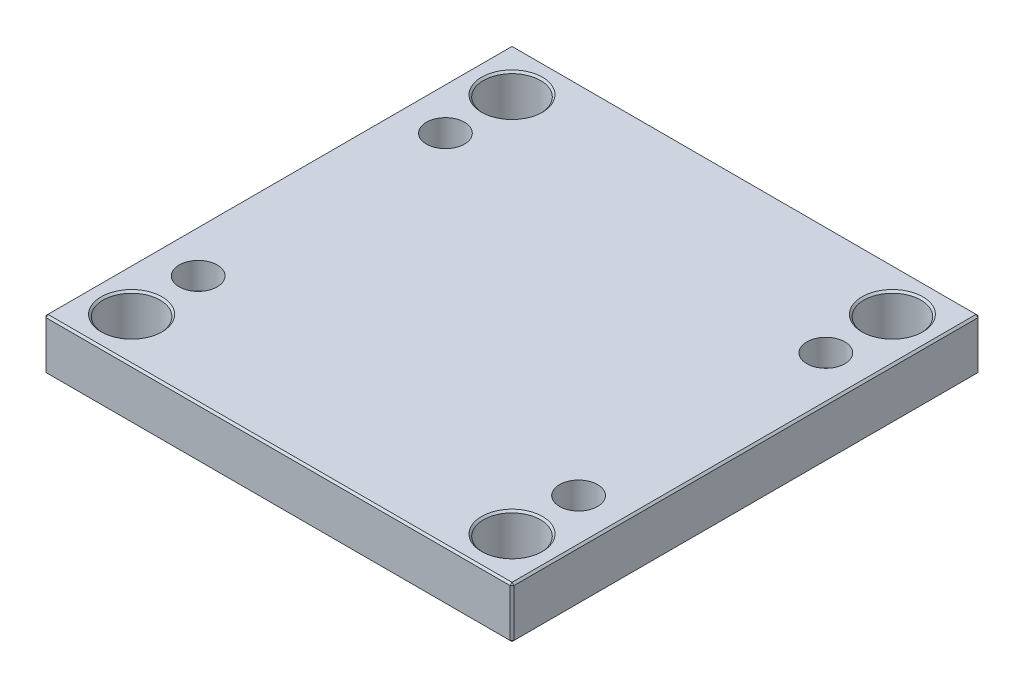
ISO-10303-21;
HEADER;
FILE_DESCRIPTION(('STEP AP214'),'2;1');
FILE_NAME('part.step','',(''),(''),'','','');
FILE_SCHEMA(('AUTOMOTIVE_DESIGN { 1 0 10303 214 1 1 1 1 }'));
ENDSEC;
DATA;
#1=APPLICATION_CONTEXT('core data for automotive mechanical design processes');
#2=APPLICATION_PROTOCOL_DEFINITION('international standard','automotive_design',2000,#1);
#3=PRODUCT_CONTEXT('',#1,'mechanical');
#4=PRODUCT('Part','Part','',(#3));
#5=PRODUCT_RELATED_PRODUCT_CATEGORY('part','',(#4));
#6=PRODUCT_DEFINITION_FORMATION('','',#4);
#7=PRODUCT_DEFINITION_CONTEXT('part definition',#1,'design');
#8=PRODUCT_DEFINITION('design','',#6,#7);
#9=PRODUCT_DEFINITION_SHAPE('','',#8);
#10=(LENGTH_UNIT() NAMED_UNIT(*) SI_UNIT(.MILLI.,.METRE.));
#11=(NAMED_UNIT(*) PLANE_ANGLE_UNIT() SI_UNIT($,.RADIAN.));
#12=(NAMED_UNIT(*) SI_UNIT($,.STERADIAN.) SOLID_ANGLE_UNIT());
#13=UNCERTAINTY_MEASURE_WITH_UNIT(LENGTH_MEASURE(1.E-05),#10,'distance_accuracy_value','');
#14=(GEOMETRIC_REPRESENTATION_CONTEXT(3) GLOBAL_UNCERTAINTY_ASSIGNED_CONTEXT((#13)) GLOBAL_UNIT_ASSIGNED_CONTEXT((#10,
#11,#12)) REPRESENTATION_CONTEXT('',''));
#15=CARTESIAN_POINT('',(0.,0.,0.));
#16=DIRECTION('',(0.,0.,1.));
#17=DIRECTION('',(1.,0.,0.));
#18=AXIS2_PLACEMENT_3D('',#15,#16,#17);
#19=CARTESIAN_POINT('',(-100.,0.,-65.));
#20=DIRECTION('',(0.,1.,0.));
#21=DIRECTION('',(0.,0.,1.));
#22=AXIS2_PLACEMENT_3D('',#19,#20,#21);
#23=CYLINDRICAL_SURFACE('',#22,6.);
#24=CARTESIAN_POINT('',(-100.,0.,-65.));
#25=DIRECTION('',(0.,1.,0.));
#26=DIRECTION('',(0.,0.,1.));
#27=AXIS2_PLACEMENT_3D('',#24,#25,#26);
#28=CIRCLE('',#27,6.);
#29=CARTESIAN_POINT('',(-100.,0.,-59.));
#30=VERTEX_POINT('',#29);
#31=EDGE_CURVE('E150',#30,#30,#28,.T.);
#32=ORIENTED_EDGE('',*,*,#31,.F.);
#33=EDGE_LOOP('',(#32));
#34=FACE_BOUND('',#33,.T.);
#35=CARTESIAN_POINT('',(-100.,13.,-65.));
#36=DIRECTION('',(0.,1.,0.));
#37=DIRECTION('',(0.,0.,1.));
#38=AXIS2_PLACEMENT_3D('',#35,#36,#37);
#39=CIRCLE('',#38,6.);
#40=CARTESIAN_POINT('',(-100.,13.,-59.));
#41=VERTEX_POINT('',#40);
#42=EDGE_CURVE('E20',#41,#41,#39,.F.);
#43=ORIENTED_EDGE('',*,*,#42,.F.);
#44=EDGE_LOOP('',(#43));
#45=FACE_BOUND('',#44,.T.);
#46=ADVANCED_FACE('F16',(#34,#45),#23,.F.);
#47=CARTESIAN_POINT('',(100.,0.,-65.));
#48=DIRECTION('',(0.,1.,0.));
#49=DIRECTION('',(0.,0.,1.));
#50=AXIS2_PLACEMENT_3D('',#47,#48,#49);
#51=CYLINDRICAL_SURFACE('',#50,6.);
#52=CARTESIAN_POINT('',(100.,0.,-65.));
#53=DIRECTION('',(0.,1.,0.));
#54=DIRECTION('',(0.,0.,1.));
#55=AXIS2_PLACEMENT_3D('',#52,#53,#54);
#56=CIRCLE('',#55,6.);
#57=CARTESIAN_POINT('',(100.,0.,-59.));
#58=VERTEX_POINT('',#57);
#59=EDGE_CURVE('E307',#58,#58,#56,.T.);
#60=ORIENTED_EDGE('',*,*,#59,.F.);
#61=EDGE_LOOP('',(#60));
#62=FACE_BOUND('',#61,.T.);
#63=CARTESIAN_POINT('',(100.,13.,-65.));
#64=DIRECTION('',(0.,1.,0.));
#65=DIRECTION('',(0.,0.,1.));
#66=AXIS2_PLACEMENT_3D('',#63,#64,#65);
#67=CIRCLE('',#66,6.);
#68=CARTESIAN_POINT('',(100.,13.,-59.));
#69=VERTEX_POINT('',#68);
#70=EDGE_CURVE('E294',#69,#69,#67,.F.);
#71=ORIENTED_EDGE('',*,*,#70,.F.);
#72=EDGE_LOOP('',(#71));
#73=FACE_BOUND('',#72,.T.);
#74=ADVANCED_FACE('F473',(#62,#73),#51,.F.);
#75=CARTESIAN_POINT('',(100.,0.,65.));
#76=DIRECTION('',(0.,1.,0.));
#77=DIRECTION('',(0.,0.,1.));
#78=AXIS2_PLACEMENT_3D('',#75,#76,#77);
#79=CYLINDRICAL_SURFACE('',#78,6.);
#80=CARTESIAN_POINT('',(100.,0.,65.));
#81=DIRECTION('',(0.,1.,0.));
#82=DIRECTION('',(0.,0.,1.));
#83=AXIS2_PLACEMENT_3D('',#80,#81,#82);
#84=CIRCLE('',#83,6.);
#85=CARTESIAN_POINT('',(100.,0.,71.));
#86=VERTEX_POINT('',#85);
#87=EDGE_CURVE('E303',#86,#86,#84,.T.);
#88=ORIENTED_EDGE('',*,*,#87,.F.);
#89=EDGE_LOOP('',(#88));
#90=FACE_BOUND('',#89,.T.);
#91=CARTESIAN_POINT('',(100.,13.,65.));
#92=DIRECTION('',(0.,1.,0.));
#93=DIRECTION('',(0.,0.,1.));
#94=AXIS2_PLACEMENT_3D('',#91,#92,#93);
#95=CIRCLE('',#94,6.);
#96=CARTESIAN_POINT('',(100.,13.,71.));
#97=VERTEX_POINT('',#96);
#98=EDGE_CURVE('E291',#97,#97,#95,.F.);
#99=ORIENTED_EDGE('',*,*,#98,.F.);
#100=EDGE_LOOP('',(#99));
#101=FACE_BOUND('',#100,.T.);
#102=ADVANCED_FACE('F480',(#90,#101),#79,.F.);
#103=CARTESIAN_POINT('',(-100.,0.,65.));
#104=DIRECTION('',(0.,1.,0.));
#105=DIRECTION('',(0.,0.,1.));
#106=AXIS2_PLACEMENT_3D('',#103,#104,#105);
#107=CYLINDRICAL_SURFACE('',#106,6.);
#108=CARTESIAN_POINT('',(-100.,0.,65.));
#109=DIRECTION('',(0.,1.,0.));
#110=DIRECTION('',(0.,0.,1.));
#111=AXIS2_PLACEMENT_3D('',#108,#109,#110);
#112=CIRCLE('',#111,6.);
#113=CARTESIAN_POINT('',(-100.,0.,71.));
#114=VERTEX_POINT('',#113);
#115=EDGE_CURVE('E299',#114,#114,#112,.T.);
#116=ORIENTED_EDGE('',*,*,#115,.F.);
#117=EDGE_LOOP('',(#116));
#118=FACE_BOUND('',#117,.T.);
#119=CARTESIAN_POINT('',(-100.,13.,65.));
#120=DIRECTION('',(0.,1.,0.));
#121=DIRECTION('',(0.,0.,1.));
#122=AXIS2_PLACEMENT_3D('',#119,#120,#121);
#123=CIRCLE('',#122,6.);
#124=CARTESIAN_POINT('',(-100.,13.,71.));
#125=VERTEX_POINT('',#124);
#126=EDGE_CURVE('E288',#125,#125,#123,.F.);
#127=ORIENTED_EDGE('',*,*,#126,.F.);
#128=EDGE_LOOP('',(#127));
#129=FACE_BOUND('',#128,.T.);
#130=ADVANCED_FACE('F485',(#118,#129),#107,.F.);
#131=CARTESIAN_POINT('',(-123.,27.,123.));
#132=DIRECTION('',(1.,0.,0.));
#133=DIRECTION('',(0.,0.,-1.));
#134=AXIS2_PLACEMENT_3D('',#131,#132,#133);
#135=PLANE('',#134);
#136=DIRECTION('',(0.,-1.,0.));
#137=VECTOR('',#136,1.);
#138=CARTESIAN_POINT('',(-123.,27.,-122.));
#139=LINE('',#138,#137);
#140=CARTESIAN_POINT('',(-123.,26.,-122.));
#141=VERTEX_POINT('',#140);
#142=CARTESIAN_POINT('',(-123.,1.,-122.));
#143=VERTEX_POINT('',#142);
#144=EDGE_CURVE('E118',#141,#143,#139,.T.);
#145=ORIENTED_EDGE('',*,*,#144,.T.);
#146=DIRECTION('',(0.,0.,1.));
#147=VECTOR('',#146,1.);
#148=CARTESIAN_POINT('',(-123.,1.,123.));
#149=LINE('',#148,#147);
#150=CARTESIAN_POINT('',(-123.,1.,122.));
#151=VERTEX_POINT('',#150);
#152=EDGE_CURVE('E114',#143,#151,#149,.T.);
#153=ORIENTED_EDGE('',*,*,#152,.T.);
#154=DIRECTION('',(0.,1.,0.));
#155=VECTOR('',#154,1.);
#156=CARTESIAN_POINT('',(-123.,27.,122.));
#157=LINE('',#156,#155);
#158=CARTESIAN_POINT('',(-123.,26.,122.));
#159=VERTEX_POINT('',#158);
#160=EDGE_CURVE('E106',#151,#159,#157,.T.);
#161=ORIENTED_EDGE('',*,*,#160,.T.);
#162=DIRECTION('',(0.,0.,-1.));
#163=VECTOR('',#162,1.);
#164=CARTESIAN_POINT('',(-123.,26.,-123.));
#165=LINE('',#164,#163);
#166=EDGE_CURVE('E111',#159,#141,#165,.T.);
#167=ORIENTED_EDGE('',*,*,#166,.T.);
#168=EDGE_LOOP('',(#145,#153,#161,#167));
#169=FACE_BOUND('',#168,.T.);
#170=ADVANCED_FACE('F109',(#169),#135,.F.);
#171=CARTESIAN_POINT('',(123.,27.,123.));
#172=DIRECTION('',(0.,0.,-1.));
#173=DIRECTION('',(-1.,0.,0.));
#174=AXIS2_PLACEMENT_3D('',#171,#172,#173);
#175=PLANE('',#174);
#176=DIRECTION('',(-1.,0.,0.));
#177=VECTOR('',#176,1.);
#178=CARTESIAN_POINT('',(-123.,26.,123.));
#179=LINE('',#178,#177);
#180=CARTESIAN_POINT('',(122.,26.,123.));
#181=VERTEX_POINT('',#180);
#182=CARTESIAN_POINT('',(-122.,26.,123.));
#183=VERTEX_POINT('',#182);
#184=EDGE_CURVE('E173',#181,#183,#179,.T.);
#185=ORIENTED_EDGE('',*,*,#184,.T.);
#186=DIRECTION('',(0.,-1.,0.));
#187=VECTOR('',#186,1.);
#188=CARTESIAN_POINT('',(-122.,27.,123.));
#189=LINE('',#188,#187);
#190=CARTESIAN_POINT('',(-122.,1.,123.));
#191=VERTEX_POINT('',#190);
#192=EDGE_CURVE('E126',#183,#191,#189,.T.);
#193=ORIENTED_EDGE('',*,*,#192,.T.);
#194=DIRECTION('',(1.,0.,0.));
#195=VECTOR('',#194,1.);
#196=CARTESIAN_POINT('',(123.,1.,123.));
#197=LINE('',#196,#195);
#198=CARTESIAN_POINT('',(122.,1.,123.));
#199=VERTEX_POINT('',#198);
#200=EDGE_CURVE('E177',#191,#199,#197,.T.);
#201=ORIENTED_EDGE('',*,*,#200,.T.);
#202=DIRECTION('',(0.,1.,0.));
#203=VECTOR('',#202,1.);
#204=CARTESIAN_POINT('',(122.,27.,123.));
#205=LINE('',#204,#203);
#206=EDGE_CURVE('E175',#199,#181,#205,.T.);
#207=ORIENTED_EDGE('',*,*,#206,.T.);
#208=EDGE_LOOP('',(#185,#193,#201,#207));
#209=FACE_BOUND('',#208,.T.);
#210=ADVANCED_FACE('F438',(#209),#175,.F.);
#211=CARTESIAN_POINT('',(123.,27.,123.));
#212=DIRECTION('',(-1.,0.,0.));
#213=DIRECTION('',(0.,0.,1.));
#214=AXIS2_PLACEMENT_3D('',#211,#212,#213);
#215=PLANE('',#214);
#216=DIRECTION('',(0.,0.,-1.));
#217=VECTOR('',#216,1.);
#218=CARTESIAN_POINT('',(123.,1.,123.));
#219=LINE('',#218,#217);
#220=CARTESIAN_POINT('',(123.,1.,122.));
#221=VERTEX_POINT('',#220);
#222=CARTESIAN_POINT('',(123.,1.,-122.));
#223=VERTEX_POINT('',#222);
#224=EDGE_CURVE('E168',#221,#223,#219,.T.);
#225=ORIENTED_EDGE('',*,*,#224,.T.);
#226=DIRECTION('',(0.,1.,0.));
#227=VECTOR('',#226,1.);
#228=CARTESIAN_POINT('',(123.,27.,-122.));
#229=LINE('',#228,#227);
#230=CARTESIAN_POINT('',(123.,26.,-122.));
#231=VERTEX_POINT('',#230);
#232=EDGE_CURVE('E170',#223,#231,#229,.T.);
#233=ORIENTED_EDGE('',*,*,#232,.T.);
#234=DIRECTION('',(0.,0.,1.));
#235=VECTOR('',#234,1.);
#236=CARTESIAN_POINT('',(123.,26.,123.));
#237=LINE('',#236,#235);
#238=CARTESIAN_POINT('',(123.,26.,122.));
#239=VERTEX_POINT('',#238);
#240=EDGE_CURVE('E164',#231,#239,#237,.T.);
#241=ORIENTED_EDGE('',*,*,#240,.T.);
#242=DIRECTION('',(0.,-1.,0.));
#243=VECTOR('',#242,1.);
#244=CARTESIAN_POINT('',(123.,27.,122.));
#245=LINE('',#244,#243);
#246=EDGE_CURVE('E166',#239,#221,#245,.T.);
#247=ORIENTED_EDGE('',*,*,#246,.T.);
#248=EDGE_LOOP('',(#225,#233,#241,#247));
#249=FACE_BOUND('',#248,.T.);
#250=ADVANCED_FACE('F431',(#249),#215,.F.);
#251=CARTESIAN_POINT('',(123.,27.,-123.));
#252=DIRECTION('',(0.,0.,1.));
#253=DIRECTION('',(1.,0.,0.));
#254=AXIS2_PLACEMENT_3D('',#251,#252,#253);
#255=PLANE('',#254);
#256=DIRECTION('',(0.,-1.,0.));
#257=VECTOR('',#256,1.);
#258=CARTESIAN_POINT('',(122.,27.,-123.));
#259=LINE('',#258,#257);
#260=CARTESIAN_POINT('',(122.,26.,-123.));
#261=VERTEX_POINT('',#260);
#262=CARTESIAN_POINT('',(122.,1.,-123.));
#263=VERTEX_POINT('',#262);
#264=EDGE_CURVE('E157',#261,#263,#259,.T.);
#265=ORIENTED_EDGE('',*,*,#264,.T.);
#266=DIRECTION('',(-1.,0.,0.));
#267=VECTOR('',#266,1.);
#268=CARTESIAN_POINT('',(123.,1.,-123.));
#269=LINE('',#268,#267);
#270=CARTESIAN_POINT('',(-122.,1.,-123.));
#271=VERTEX_POINT('',#270);
#272=EDGE_CURVE('E162',#263,#271,#269,.T.);
#273=ORIENTED_EDGE('',*,*,#272,.T.);
#274=DIRECTION('',(0.,1.,0.));
#275=VECTOR('',#274,1.);
#276=CARTESIAN_POINT('',(-122.,27.,-123.));
#277=LINE('',#276,#275);
#278=CARTESIAN_POINT('',(-122.,26.,-123.));
#279=VERTEX_POINT('',#278);
#280=EDGE_CURVE('E159',#271,#279,#277,.T.);
#281=ORIENTED_EDGE('',*,*,#280,.T.);
#282=DIRECTION('',(1.,0.,0.));
#283=VECTOR('',#282,1.);
#284=CARTESIAN_POINT('',(123.,26.,-123.));
#285=LINE('',#284,#283);
#286=EDGE_CURVE('E155',#279,#261,#285,.T.);
#287=ORIENTED_EDGE('',*,*,#286,.T.);
#288=EDGE_LOOP('',(#265,#273,#281,#287));
#289=FACE_BOUND('',#288,.T.);
#290=ADVANCED_FACE('F349',(#289),#255,.F.);
#291=CARTESIAN_POINT('',(0.,27.,0.));
#292=DIRECTION('',(0.,1.,0.));
#293=DIRECTION('',(0.,0.,1.));
#294=AXIS2_PLACEMENT_3D('',#291,#292,#293);
#295=PLANE('',#294);
#296=CARTESIAN_POINT('',(-100.,27.,65.));
#297=DIRECTION('',(0.,1.,0.));
#298=DIRECTION('',(0.,0.,1.));
#299=AXIS2_PLACEMENT_3D('',#296,#297,#298);
#300=CIRCLE('',#299,10.);
#301=CARTESIAN_POINT('',(-100.,27.,75.));
#302=VERTEX_POINT('',#301);
#303=EDGE_CURVE('E318',#302,#302,#300,.T.);
#304=ORIENTED_EDGE('',*,*,#303,.F.);
#305=EDGE_LOOP('',(#304));
#306=FACE_BOUND('',#305,.T.);
#307=CARTESIAN_POINT('',(100.,27.,65.));
#308=DIRECTION('',(0.,1.,0.));
#309=DIRECTION('',(0.,0.,1.));
#310=AXIS2_PLACEMENT_3D('',#307,#308,#309);
#311=CIRCLE('',#310,10.);
#312=CARTESIAN_POINT('',(100.,27.,75.));
#313=VERTEX_POINT('',#312);
#314=EDGE_CURVE('E324',#313,#313,#311,.T.);
#315=ORIENTED_EDGE('',*,*,#314,.F.);
#316=EDGE_LOOP('',(#315));
#317=FACE_BOUND('',#316,.T.);
#318=CARTESIAN_POINT('',(100.,27.,-65.));
#319=DIRECTION('',(0.,1.,0.));
#320=DIRECTION('',(0.,0.,1.));
#321=AXIS2_PLACEMENT_3D('',#318,#319,#320);
#322=CIRCLE('',#321,10.);
#323=CARTESIAN_POINT('',(100.,27.,-55.));
#324=VERTEX_POINT('',#323);
#325=EDGE_CURVE('E330',#324,#324,#322,.T.);
#326=ORIENTED_EDGE('',*,*,#325,.F.);
#327=EDGE_LOOP('',(#326));
#328=FACE_BOUND('',#327,.T.);
#329=CARTESIAN_POINT('',(-100.,27.,-65.));
#330=DIRECTION('',(0.,1.,0.));
#331=DIRECTION('',(0.,0.,1.));
#332=AXIS2_PLACEMENT_3D('',#329,#330,#331);
#333=CIRCLE('',#332,10.);
#334=CARTESIAN_POINT('',(-100.,27.,-55.));
#335=VERTEX_POINT('',#334);
#336=EDGE_CURVE('E312',#335,#335,#333,.T.);
#337=ORIENTED_EDGE('',*,*,#336,.F.);
#338=EDGE_LOOP('',(#337));
#339=FACE_BOUND('',#338,.T.);
#340=CARTESIAN_POINT('',(-100.,27.,100.));
#341=DIRECTION('',(0.,1.,0.));
#342=DIRECTION('',(0.,0.,1.));
#343=AXIS2_PLACEMENT_3D('',#340,#341,#342);
#344=CIRCLE('',#343,16.);
#345=CARTESIAN_POINT('',(-100.,27.,116.));
#346=VERTEX_POINT('',#345);
#347=EDGE_CURVE('E259',#346,#346,#344,.F.);
#348=ORIENTED_EDGE('',*,*,#347,.T.);
#349=EDGE_LOOP('',(#348));
#350=FACE_BOUND('',#349,.T.);
#351=CARTESIAN_POINT('',(100.,27.,100.));
#352=DIRECTION('',(0.,1.,0.));
#353=DIRECTION('',(0.,0.,1.));
#354=AXIS2_PLACEMENT_3D('',#351,#352,#353);
#355=CIRCLE('',#354,16.);
#356=CARTESIAN_POINT('',(100.,27.,116.));
#357=VERTEX_POINT('',#356);
#358=EDGE_CURVE('E256',#357,#357,#355,.F.);
#359=ORIENTED_EDGE('',*,*,#358,.T.);
#360=EDGE_LOOP('',(#359));
#361=FACE_BOUND('',#360,.T.);
#362=CARTESIAN_POINT('',(100.,27.,-100.));
#363=DIRECTION('',(0.,1.,0.));
#364=DIRECTION('',(0.,0.,1.));
#365=AXIS2_PLACEMENT_3D('',#362,#363,#364);
#366=CIRCLE('',#365,16.);
#367=CARTESIAN_POINT('',(100.,27.,-84.));
#368=VERTEX_POINT('',#367);
#369=EDGE_CURVE('E253',#368,#368,#366,.F.);
#370=ORIENTED_EDGE('',*,*,#369,.T.);
#371=EDGE_LOOP('',(#370));
#372=FACE_BOUND('',#371,.T.);
#373=CARTESIAN_POINT('',(-100.,27.,-100.));
#374=DIRECTION('',(0.,1.,0.));
#375=DIRECTION('',(0.,0.,1.));
#376=AXIS2_PLACEMENT_3D('',#373,#374,#375);
#377=CIRCLE('',#376,16.);
#378=CARTESIAN_POINT('',(-100.,27.,-84.));
#379=VERTEX_POINT('',#378);
#380=EDGE_CURVE('E250',#379,#379,#377,.F.);
#381=ORIENTED_EDGE('',*,*,#380,.T.);
#382=EDGE_LOOP('',(#381));
#383=FACE_BOUND('',#382,.T.);
#384=DIRECTION('',(0.,0.,-1.));
#385=VECTOR('',#384,1.);
#386=CARTESIAN_POINT('',(122.,27.,-123.));
#387=LINE('',#386,#385);
#388=CARTESIAN_POINT('',(122.,27.,122.));
#389=VERTEX_POINT('',#388);
#390=CARTESIAN_POINT('',(122.,27.,-122.));
#391=VERTEX_POINT('',#390);
#392=EDGE_CURVE('E33',#389,#391,#387,.T.);
#393=ORIENTED_EDGE('',*,*,#392,.T.);
#394=DIRECTION('',(-1.,0.,0.));
#395=VECTOR('',#394,1.);
#396=CARTESIAN_POINT('',(-123.,27.,-122.));
#397=LINE('',#396,#395);
#398=CARTESIAN_POINT('',(-122.,27.,-122.));
#399=VERTEX_POINT('',#398);
#400=EDGE_CURVE('E193',#391,#399,#397,.T.);
#401=ORIENTED_EDGE('',*,*,#400,.T.);
#402=DIRECTION('',(0.,0.,1.));
#403=VECTOR('',#402,1.);
#404=CARTESIAN_POINT('',(-122.,27.,123.));
#405=LINE('',#404,#403);
#406=CARTESIAN_POINT('',(-122.,27.,122.));
#407=VERTEX_POINT('',#406);
#408=EDGE_CURVE('E189',#399,#407,#405,.T.);
#409=ORIENTED_EDGE('',*,*,#408,.T.);
#410=DIRECTION('',(1.,0.,0.));
#411=VECTOR('',#410,1.);
#412=CARTESIAN_POINT('',(123.,27.,122.));
#413=LINE('',#412,#411);
#414=EDGE_CURVE('E38',#407,#389,#413,.T.);
#415=ORIENTED_EDGE('',*,*,#414,.T.);
#416=EDGE_LOOP('',(#393,#401,#409,#415));
#417=FACE_BOUND('',#416,.T.);
#418=ADVANCED_FACE('F345',(#306,#317,#328,#339,#350,#361,#372,#383,#417),#295,.T.);
#419=CARTESIAN_POINT('',(0.,0.,0.));
#420=DIRECTION('',(0.,1.,0.));
#421=DIRECTION('',(0.,0.,1.));
#422=AXIS2_PLACEMENT_3D('',#419,#420,#421);
#423=PLANE('',#422);
#424=CARTESIAN_POINT('',(-100.,0.,100.));
#425=DIRECTION('',(0.,1.,0.));
#426=DIRECTION('',(0.,0.,1.));
#427=AXIS2_PLACEMENT_3D('',#424,#425,#426);
#428=CIRCLE('',#427,16.);
#429=CARTESIAN_POINT('',(-100.,0.,116.));
#430=VERTEX_POINT('',#429);
#431=EDGE_CURVE('E271',#430,#430,#428,.T.);
#432=ORIENTED_EDGE('',*,*,#431,.T.);
#433=EDGE_LOOP('',(#432));
#434=FACE_BOUND('',#433,.T.);
#435=CARTESIAN_POINT('',(100.,0.,100.));
#436=DIRECTION('',(0.,1.,0.));
#437=DIRECTION('',(0.,0.,1.));
#438=AXIS2_PLACEMENT_3D('',#435,#436,#437);
#439=CIRCLE('',#438,16.);
#440=CARTESIAN_POINT('',(100.,0.,116.));
#441=VERTEX_POINT('',#440);
#442=EDGE_CURVE('E268',#441,#441,#439,.T.);
#443=ORIENTED_EDGE('',*,*,#442,.T.);
#444=EDGE_LOOP('',(#443));
#445=FACE_BOUND('',#444,.T.);
#446=CARTESIAN_POINT('',(100.,0.,-100.));
#447=DIRECTION('',(0.,1.,0.));
#448=DIRECTION('',(0.,0.,1.));
#449=AXIS2_PLACEMENT_3D('',#446,#447,#448);
#450=CIRCLE('',#449,16.);
#451=CARTESIAN_POINT('',(100.,0.,-84.));
#452=VERTEX_POINT('',#451);
#453=EDGE_CURVE('E265',#452,#452,#450,.T.);
#454=ORIENTED_EDGE('',*,*,#453,.T.);
#455=EDGE_LOOP('',(#454));
#456=FACE_BOUND('',#455,.T.);
#457=CARTESIAN_POINT('',(-100.,0.,-100.));
#458=DIRECTION('',(0.,1.,0.));
#459=DIRECTION('',(0.,0.,1.));
#460=AXIS2_PLACEMENT_3D('',#457,#458,#459);
#461=CIRCLE('',#460,16.);
#462=CARTESIAN_POINT('',(-100.,0.,-84.));
#463=VERTEX_POINT('',#462);
#464=EDGE_CURVE('E262',#463,#463,#461,.T.);
#465=ORIENTED_EDGE('',*,*,#464,.T.);
#466=EDGE_LOOP('',(#465));
#467=FACE_BOUND('',#466,.T.);
#468=ORIENTED_EDGE('',*,*,#115,.T.);
#469=EDGE_LOOP('',(#468));
#470=FACE_BOUND('',#469,.T.);
#471=ORIENTED_EDGE('',*,*,#87,.T.);
#472=EDGE_LOOP('',(#471));
#473=FACE_BOUND('',#472,.T.);
#474=ORIENTED_EDGE('',*,*,#59,.T.);
#475=EDGE_LOOP('',(#474));
#476=FACE_BOUND('',#475,.T.);
#477=ORIENTED_EDGE('',*,*,#31,.T.);
#478=EDGE_LOOP('',(#477));
#479=FACE_BOUND('',#478,.T.);
#480=DIRECTION('',(0.,0.,1.));
#481=VECTOR('',#480,1.);
#482=CARTESIAN_POINT('',(122.,0.,0.));
#483=LINE('',#482,#481);
#484=CARTESIAN_POINT('',(122.,0.,-122.));
#485=VERTEX_POINT('',#484);
#486=CARTESIAN_POINT('',(122.,0.,122.));
#487=VERTEX_POINT('',#486);
#488=EDGE_CURVE('E180',#485,#487,#483,.T.);
#489=ORIENTED_EDGE('',*,*,#488,.T.);
#490=DIRECTION('',(-1.,0.,0.));
#491=VECTOR('',#490,1.);
#492=CARTESIAN_POINT('',(0.,0.,122.));
#493=LINE('',#492,#491);
#494=CARTESIAN_POINT('',(-122.,0.,122.));
#495=VERTEX_POINT('',#494);
#496=EDGE_CURVE('E186',#487,#495,#493,.T.);
#497=ORIENTED_EDGE('',*,*,#496,.T.);
#498=DIRECTION('',(0.,0.,-1.));
#499=VECTOR('',#498,1.);
#500=CARTESIAN_POINT('',(-122.,0.,0.));
#501=LINE('',#500,#499);
#502=CARTESIAN_POINT('',(-122.,0.,-122.));
#503=VERTEX_POINT('',#502);
#504=EDGE_CURVE('E184',#495,#503,#501,.T.);
#505=ORIENTED_EDGE('',*,*,#504,.T.);
#506=DIRECTION('',(1.,0.,0.));
#507=VECTOR('',#506,1.);
#508=CARTESIAN_POINT('',(0.,0.,-122.));
#509=LINE('',#508,#507);
#510=EDGE_CURVE('E182',#503,#485,#509,.T.);
#511=ORIENTED_EDGE('',*,*,#510,.T.);
#512=EDGE_LOOP('',(#489,#497,#505,#511));
#513=FACE_BOUND('',#512,.T.);
#514=ADVANCED_FACE('F348',(#434,#445,#456,#467,#470,#473,#476,#479,#513),#423,.F.);
#515=CARTESIAN_POINT('',(123.,27.,122.));
#516=DIRECTION('',(-0.707106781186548,0.,-0.707106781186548));
#517=DIRECTION('',(0.,-1.,0.));
#518=AXIS2_PLACEMENT_3D('',#515,#516,#517);
#519=PLANE('',#518);
#520=DIRECTION('',(-0.707106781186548,0.,0.707106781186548));
#521=VECTOR('',#520,1.);
#522=CARTESIAN_POINT('',(122.,26.,123.));
#523=LINE('',#522,#521);
#524=EDGE_CURVE('E144',#181,#239,#523,.F.);
#525=ORIENTED_EDGE('',*,*,#524,.F.);
#526=ORIENTED_EDGE('',*,*,#206,.F.);
#527=DIRECTION('',(0.707106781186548,0.,-0.707106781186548));
#528=VECTOR('',#527,1.);
#529=CARTESIAN_POINT('',(122.,1.,123.));
#530=LINE('',#529,#528);
#531=EDGE_CURVE('E147',#221,#199,#530,.F.);
#532=ORIENTED_EDGE('',*,*,#531,.F.);
#533=ORIENTED_EDGE('',*,*,#246,.F.);
#534=EDGE_LOOP('',(#525,#526,#532,#533));
#535=FACE_BOUND('',#534,.T.);
#536=ADVANCED_FACE('F382',(#535),#519,.F.);
#537=CARTESIAN_POINT('',(122.,26.,123.));
#538=DIRECTION('',(0.577350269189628,0.57735026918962,0.577350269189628));
#539=DIRECTION('',(0.707106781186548,0.,-0.707106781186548));
#540=AXIS2_PLACEMENT_3D('',#537,#538,#539);
#541=PLANE('',#540);
#542=DIRECTION('',(0.,-0.70710678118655,0.707106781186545));
#543=VECTOR('',#542,1.);
#544=CARTESIAN_POINT('',(122.,26.,123.));
#545=LINE('',#544,#543);
#546=EDGE_CURVE('E238',#181,#389,#545,.F.);
#547=ORIENTED_EDGE('',*,*,#546,.F.);
#548=ORIENTED_EDGE('',*,*,#524,.T.);
#549=DIRECTION('',(-0.707106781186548,0.707106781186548,0.));
#550=VECTOR('',#549,1.);
#551=CARTESIAN_POINT('',(122.5,26.5,122.));
#552=LINE('',#551,#550);
#553=EDGE_CURVE('E240',#389,#239,#552,.F.);
#554=ORIENTED_EDGE('',*,*,#553,.F.);
#555=EDGE_LOOP('',(#547,#548,#554));
#556=FACE_BOUND('',#555,.T.);
#557=ADVANCED_FACE('F444',(#556),#541,.T.);
#558=CARTESIAN_POINT('',(122.,1.,123.));
#559=DIRECTION('',(0.577350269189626,-0.577350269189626,0.577350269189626));
#560=DIRECTION('',(0.707106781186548,0.,-0.707106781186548));
#561=AXIS2_PLACEMENT_3D('',#558,#559,#560);
#562=PLANE('',#561);
#563=DIRECTION('',(-0.707106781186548,-0.707106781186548,0.));
#564=VECTOR('',#563,1.);
#565=CARTESIAN_POINT('',(122.5,0.5,122.));
#566=LINE('',#565,#564);
#567=EDGE_CURVE('E232',#221,#487,#566,.T.);
#568=ORIENTED_EDGE('',*,*,#567,.F.);
#569=ORIENTED_EDGE('',*,*,#531,.T.);
#570=DIRECTION('',(0.,0.70710678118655,0.707106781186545));
#571=VECTOR('',#570,1.);
#572=CARTESIAN_POINT('',(122.,1.,123.));
#573=LINE('',#572,#571);
#574=EDGE_CURVE('E235',#487,#199,#573,.T.);
#575=ORIENTED_EDGE('',*,*,#574,.F.);
#576=EDGE_LOOP('',(#568,#569,#575));
#577=FACE_BOUND('',#576,.T.);
#578=ADVANCED_FACE('F403',(#577),#562,.T.);
#579=CARTESIAN_POINT('',(122.,27.,0.));
#580=DIRECTION('',(0.707106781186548,0.707106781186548,0.));
#581=DIRECTION('',(0.,0.,1.));
#582=AXIS2_PLACEMENT_3D('',#579,#580,#581);
#583=PLANE('',#582);
#584=ORIENTED_EDGE('',*,*,#553,.T.);
#585=ORIENTED_EDGE('',*,*,#240,.F.);
#586=DIRECTION('',(0.707106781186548,-0.707106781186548,0.));
#587=VECTOR('',#586,1.);
#588=CARTESIAN_POINT('',(123.,26.,-122.));
#589=LINE('',#588,#587);
#590=EDGE_CURVE('E227',#391,#231,#589,.T.);
#591=ORIENTED_EDGE('',*,*,#590,.F.);
#592=ORIENTED_EDGE('',*,*,#392,.F.);
#593=EDGE_LOOP('',(#584,#585,#591,#592));
#594=FACE_BOUND('',#593,.T.);
#595=ADVANCED_FACE('F446',(#594),#583,.T.);
#596=CARTESIAN_POINT('',(0.,27.,122.));
#597=DIRECTION('',(0.,0.707106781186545,0.70710678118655));
#598=DIRECTION('',(-1.,0.,0.));
#599=AXIS2_PLACEMENT_3D('',#596,#597,#598);
#600=PLANE('',#599);
#601=ORIENTED_EDGE('',*,*,#546,.T.);
#602=ORIENTED_EDGE('',*,*,#414,.F.);
#603=DIRECTION('',(0.,0.70710678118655,-0.707106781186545));
#604=VECTOR('',#603,1.);
#605=CARTESIAN_POINT('',(-122.,26.5,122.5));
#606=LINE('',#605,#604);
#607=EDGE_CURVE('E130',#183,#407,#606,.T.);
#608=ORIENTED_EDGE('',*,*,#607,.F.);
#609=ORIENTED_EDGE('',*,*,#184,.F.);
#610=EDGE_LOOP('',(#601,#602,#608,#609));
#611=FACE_BOUND('',#610,.T.);
#612=ADVANCED_FACE('F441',(#611),#600,.T.);
#613=CARTESIAN_POINT('',(-122.,27.,123.));
#614=DIRECTION('',(0.707106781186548,0.,-0.707106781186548));
#615=DIRECTION('',(0.,-1.,0.));
#616=AXIS2_PLACEMENT_3D('',#613,#614,#615);
#617=PLANE('',#616);
#618=DIRECTION('',(0.707106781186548,0.,0.707106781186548));
#619=VECTOR('',#618,1.);
#620=CARTESIAN_POINT('',(-122.,1.,123.));
#621=LINE('',#620,#619);
#622=EDGE_CURVE('E131',#191,#151,#621,.F.);
#623=ORIENTED_EDGE('',*,*,#622,.F.);
#624=ORIENTED_EDGE('',*,*,#192,.F.);
#625=DIRECTION('',(-0.707106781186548,0.,-0.707106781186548));
#626=VECTOR('',#625,1.);
#627=CARTESIAN_POINT('',(-123.,26.,122.));
#628=LINE('',#627,#626);
#629=EDGE_CURVE('E122',#159,#183,#628,.F.);
#630=ORIENTED_EDGE('',*,*,#629,.F.);
#631=ORIENTED_EDGE('',*,*,#160,.F.);
#632=EDGE_LOOP('',(#623,#624,#630,#631));
#633=FACE_BOUND('',#632,.T.);
#634=ADVANCED_FACE('F124',(#633),#617,.F.);
#635=CARTESIAN_POINT('',(123.,1.,123.));
#636=DIRECTION('',(0.,0.707106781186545,-0.70710678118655));
#637=DIRECTION('',(1.,0.,0.));
#638=AXIS2_PLACEMENT_3D('',#635,#636,#637);
#639=PLANE('',#638);
#640=ORIENTED_EDGE('',*,*,#574,.T.);
#641=ORIENTED_EDGE('',*,*,#200,.F.);
#642=DIRECTION('',(0.,-0.70710678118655,-0.707106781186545));
#643=VECTOR('',#642,1.);
#644=CARTESIAN_POINT('',(-122.,1.,123.));
#645=LINE('',#644,#643);
#646=EDGE_CURVE('E223',#495,#191,#645,.F.);
#647=ORIENTED_EDGE('',*,*,#646,.F.);
#648=ORIENTED_EDGE('',*,*,#496,.F.);
#649=EDGE_LOOP('',(#640,#641,#647,#648));
#650=FACE_BOUND('',#649,.T.);
#651=ADVANCED_FACE('F408',(#650),#639,.F.);
#652=CARTESIAN_POINT('',(123.,1.,123.));
#653=DIRECTION('',(-0.707106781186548,0.707106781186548,0.));
#654=DIRECTION('',(0.,0.,-1.));
#655=AXIS2_PLACEMENT_3D('',#652,#653,#654);
#656=PLANE('',#655);
#657=ORIENTED_EDGE('',*,*,#567,.T.);
#658=ORIENTED_EDGE('',*,*,#488,.F.);
#659=DIRECTION('',(0.707106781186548,0.707106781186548,0.));
#660=VECTOR('',#659,1.);
#661=CARTESIAN_POINT('',(122.5,0.499999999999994,-122.));
#662=LINE('',#661,#660);
#663=EDGE_CURVE('E220',#223,#485,#662,.F.);
#664=ORIENTED_EDGE('',*,*,#663,.F.);
#665=ORIENTED_EDGE('',*,*,#224,.F.);
#666=EDGE_LOOP('',(#657,#658,#664,#665));
#667=FACE_BOUND('',#666,.T.);
#668=ADVANCED_FACE('F401',(#667),#656,.F.);
#669=CARTESIAN_POINT('',(122.,27.,-123.));
#670=DIRECTION('',(-0.707106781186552,0.,0.707106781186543));
#671=DIRECTION('',(0.,-1.,0.));
#672=AXIS2_PLACEMENT_3D('',#669,#670,#671);
#673=PLANE('',#672);
#674=DIRECTION('',(0.707106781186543,0.,0.707106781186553));
#675=VECTOR('',#674,1.);
#676=CARTESIAN_POINT('',(123.,26.,-122.));
#677=LINE('',#676,#675);
#678=EDGE_CURVE('E229',#231,#261,#677,.F.);
#679=ORIENTED_EDGE('',*,*,#678,.F.);
#680=ORIENTED_EDGE('',*,*,#232,.F.);
#681=DIRECTION('',(-0.707106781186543,0.,-0.707106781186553));
#682=VECTOR('',#681,1.);
#683=CARTESIAN_POINT('',(122.,1.,-123.));
#684=LINE('',#683,#682);
#685=EDGE_CURVE('E217',#263,#223,#684,.F.);
#686=ORIENTED_EDGE('',*,*,#685,.F.);
#687=ORIENTED_EDGE('',*,*,#264,.F.);
#688=EDGE_LOOP('',(#679,#680,#686,#687));
#689=FACE_BOUND('',#688,.T.);
#690=ADVANCED_FACE('F428',(#689),#673,.F.);
#691=CARTESIAN_POINT('',(123.,26.,-122.));
#692=DIRECTION('',(0.577350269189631,0.577350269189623,-0.577350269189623));
#693=DIRECTION('',(-0.707106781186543,0.,-0.707106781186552));
#694=AXIS2_PLACEMENT_3D('',#691,#692,#693);
#695=PLANE('',#694);
#696=ORIENTED_EDGE('',*,*,#590,.T.);
#697=ORIENTED_EDGE('',*,*,#678,.T.);
#698=DIRECTION('',(0.,0.707106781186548,0.707106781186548));
#699=VECTOR('',#698,1.);
#700=CARTESIAN_POINT('',(122.,26.5,-122.5));
#701=LINE('',#700,#699);
#702=EDGE_CURVE('E138',#391,#261,#701,.F.);
#703=ORIENTED_EDGE('',*,*,#702,.F.);
#704=EDGE_LOOP('',(#696,#697,#703));
#705=FACE_BOUND('',#704,.T.);
#706=ADVANCED_FACE('F450',(#705),#695,.T.);
#707=CARTESIAN_POINT('',(-123.,26.,122.));
#708=DIRECTION('',(-0.577350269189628,0.57735026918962,0.577350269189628));
#709=DIRECTION('',(0.707106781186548,0.,0.707106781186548));
#710=AXIS2_PLACEMENT_3D('',#707,#708,#709);
#711=PLANE('',#710);
#712=ORIENTED_EDGE('',*,*,#629,.T.);
#713=ORIENTED_EDGE('',*,*,#607,.T.);
#714=DIRECTION('',(-0.707106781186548,-0.707106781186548,0.));
#715=VECTOR('',#714,1.);
#716=CARTESIAN_POINT('',(-123.,26.,122.));
#717=LINE('',#716,#715);
#718=EDGE_CURVE('E134',#159,#407,#717,.F.);
#719=ORIENTED_EDGE('',*,*,#718,.F.);
#720=EDGE_LOOP('',(#712,#713,#719));
#721=FACE_BOUND('',#720,.T.);
#722=ADVANCED_FACE('F135',(#721),#711,.T.);
#723=CARTESIAN_POINT('',(-122.,1.,123.));
#724=DIRECTION('',(-0.577350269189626,-0.577350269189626,0.577350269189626));
#725=DIRECTION('',(0.707106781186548,0.,0.707106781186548));
#726=AXIS2_PLACEMENT_3D('',#723,#724,#725);
#727=PLANE('',#726);
#728=ORIENTED_EDGE('',*,*,#646,.T.);
#729=ORIENTED_EDGE('',*,*,#622,.T.);
#730=DIRECTION('',(-0.707106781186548,0.707106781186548,0.));
#731=VECTOR('',#730,1.);
#732=CARTESIAN_POINT('',(-122.5,0.5,122.));
#733=LINE('',#732,#731);
#734=EDGE_CURVE('E139',#495,#151,#733,.T.);
#735=ORIENTED_EDGE('',*,*,#734,.F.);
#736=EDGE_LOOP('',(#728,#729,#735));
#737=FACE_BOUND('',#736,.T.);
#738=ADVANCED_FACE('F411',(#737),#727,.T.);
#739=CARTESIAN_POINT('',(122.,1.,-123.));
#740=DIRECTION('',(0.577350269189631,-0.577350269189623,-0.577350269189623));
#741=DIRECTION('',(-0.707106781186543,0.,-0.707106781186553));
#742=AXIS2_PLACEMENT_3D('',#739,#740,#741);
#743=PLANE('',#742);
#744=ORIENTED_EDGE('',*,*,#685,.T.);
#745=ORIENTED_EDGE('',*,*,#663,.T.);
#746=DIRECTION('',(0.,-0.707106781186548,0.707106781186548));
#747=VECTOR('',#746,1.);
#748=CARTESIAN_POINT('',(122.,1.,-123.));
#749=LINE('',#748,#747);
#750=EDGE_CURVE('E210',#263,#485,#749,.T.);
#751=ORIENTED_EDGE('',*,*,#750,.F.);
#752=EDGE_LOOP('',(#744,#745,#751));
#753=FACE_BOUND('',#752,.T.);
#754=ADVANCED_FACE('F422',(#753),#743,.T.);
#755=CARTESIAN_POINT('',(0.,27.,-122.));
#756=DIRECTION('',(0.,0.707106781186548,-0.707106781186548));
#757=DIRECTION('',(1.,0.,0.));
#758=AXIS2_PLACEMENT_3D('',#755,#756,#757);
#759=PLANE('',#758);
#760=ORIENTED_EDGE('',*,*,#702,.T.);
#761=ORIENTED_EDGE('',*,*,#286,.F.);
#762=DIRECTION('',(0.,-0.707106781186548,-0.707106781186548));
#763=VECTOR('',#762,1.);
#764=CARTESIAN_POINT('',(-122.,26.,-123.));
#765=LINE('',#764,#763);
#766=EDGE_CURVE('E207',#399,#279,#765,.T.);
#767=ORIENTED_EDGE('',*,*,#766,.F.);
#768=ORIENTED_EDGE('',*,*,#400,.F.);
#769=EDGE_LOOP('',(#760,#761,#767,#768));
#770=FACE_BOUND('',#769,.T.);
#771=ADVANCED_FACE('F454',(#770),#759,.T.);
#772=CARTESIAN_POINT('',(-122.,27.,0.));
#773=DIRECTION('',(-0.707106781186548,0.707106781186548,0.));
#774=DIRECTION('',(0.,0.,-1.));
#775=AXIS2_PLACEMENT_3D('',#772,#773,#774);
#776=PLANE('',#775);
#777=ORIENTED_EDGE('',*,*,#718,.T.);
#778=ORIENTED_EDGE('',*,*,#408,.F.);
#779=DIRECTION('',(0.707106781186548,0.707106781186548,0.));
#780=VECTOR('',#779,1.);
#781=CARTESIAN_POINT('',(-122.5,26.5,-122.));
#782=LINE('',#781,#780);
#783=EDGE_CURVE('E142',#141,#399,#782,.T.);
#784=ORIENTED_EDGE('',*,*,#783,.F.);
#785=ORIENTED_EDGE('',*,*,#166,.F.);
#786=EDGE_LOOP('',(#777,#778,#784,#785));
#787=FACE_BOUND('',#786,.T.);
#788=ADVANCED_FACE('F141',(#787),#776,.T.);
#789=CARTESIAN_POINT('',(-123.,1.,123.));
#790=DIRECTION('',(0.707106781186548,0.707106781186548,0.));
#791=DIRECTION('',(0.,0.,1.));
#792=AXIS2_PLACEMENT_3D('',#789,#790,#791);
#793=PLANE('',#792);
#794=ORIENTED_EDGE('',*,*,#734,.T.);
#795=ORIENTED_EDGE('',*,*,#152,.F.);
#796=DIRECTION('',(0.707106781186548,-0.707106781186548,0.));
#797=VECTOR('',#796,1.);
#798=CARTESIAN_POINT('',(-123.,1.,-122.));
#799=LINE('',#798,#797);
#800=EDGE_CURVE('E203',#503,#143,#799,.F.);
#801=ORIENTED_EDGE('',*,*,#800,.F.);
#802=ORIENTED_EDGE('',*,*,#504,.F.);
#803=EDGE_LOOP('',(#794,#795,#801,#802));
#804=FACE_BOUND('',#803,.T.);
#805=ADVANCED_FACE('F413',(#804),#793,.F.);
#806=CARTESIAN_POINT('',(123.,1.,-123.));
#807=DIRECTION('',(0.,0.707106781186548,0.707106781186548));
#808=DIRECTION('',(-1.,0.,0.));
#809=AXIS2_PLACEMENT_3D('',#806,#807,#808);
#810=PLANE('',#809);
#811=ORIENTED_EDGE('',*,*,#750,.T.);
#812=ORIENTED_EDGE('',*,*,#510,.F.);
#813=DIRECTION('',(0.,0.707106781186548,-0.707106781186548));
#814=VECTOR('',#813,1.);
#815=CARTESIAN_POINT('',(-122.,0.5,-122.5));
#816=LINE('',#815,#814);
#817=EDGE_CURVE('E200',#271,#503,#816,.F.);
#818=ORIENTED_EDGE('',*,*,#817,.F.);
#819=ORIENTED_EDGE('',*,*,#272,.F.);
#820=EDGE_LOOP('',(#811,#812,#818,#819));
#821=FACE_BOUND('',#820,.T.);
#822=ADVANCED_FACE('F417',(#821),#810,.F.);
#823=CARTESIAN_POINT('',(-122.,26.,-123.));
#824=DIRECTION('',(-0.577350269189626,0.577350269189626,-0.577350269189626));
#825=DIRECTION('',(-0.707106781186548,0.,0.707106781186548));
#826=AXIS2_PLACEMENT_3D('',#823,#824,#825);
#827=PLANE('',#826);
#828=ORIENTED_EDGE('',*,*,#783,.T.);
#829=ORIENTED_EDGE('',*,*,#766,.T.);
#830=DIRECTION('',(0.707106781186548,0.,-0.707106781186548));
#831=VECTOR('',#830,1.);
#832=CARTESIAN_POINT('',(-122.,26.,-123.));
#833=LINE('',#832,#831);
#834=EDGE_CURVE('E198',#141,#279,#833,.T.);
#835=ORIENTED_EDGE('',*,*,#834,.F.);
#836=EDGE_LOOP('',(#828,#829,#835));
#837=FACE_BOUND('',#836,.T.);
#838=ADVANCED_FACE('F456',(#837),#827,.T.);
#839=CARTESIAN_POINT('',(-123.,1.,-122.));
#840=DIRECTION('',(-0.577350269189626,-0.577350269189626,-0.577350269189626));
#841=DIRECTION('',(-0.707106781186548,0.,0.707106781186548));
#842=AXIS2_PLACEMENT_3D('',#839,#840,#841);
#843=PLANE('',#842);
#844=ORIENTED_EDGE('',*,*,#817,.T.);
#845=ORIENTED_EDGE('',*,*,#800,.T.);
#846=DIRECTION('',(-0.707106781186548,0.,0.707106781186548));
#847=VECTOR('',#846,1.);
#848=CARTESIAN_POINT('',(-123.,1.,-122.));
#849=LINE('',#848,#847);
#850=EDGE_CURVE('E196',#271,#143,#849,.T.);
#851=ORIENTED_EDGE('',*,*,#850,.F.);
#852=EDGE_LOOP('',(#844,#845,#851));
#853=FACE_BOUND('',#852,.T.);
#854=ADVANCED_FACE('F461',(#853),#843,.T.);
#855=CARTESIAN_POINT('',(-123.,27.,-122.));
#856=DIRECTION('',(0.707106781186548,0.,0.707106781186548));
#857=DIRECTION('',(0.,-1.,0.));
#858=AXIS2_PLACEMENT_3D('',#855,#856,#857);
#859=PLANE('',#858);
#860=ORIENTED_EDGE('',*,*,#834,.T.);
#861=ORIENTED_EDGE('',*,*,#280,.F.);
#862=ORIENTED_EDGE('',*,*,#850,.T.);
#863=ORIENTED_EDGE('',*,*,#144,.F.);
#864=EDGE_LOOP('',(#860,#861,#862,#863));
#865=FACE_BOUND('',#864,.T.);
#866=ADVANCED_FACE('F372',(#865),#859,.F.);
#867=CARTESIAN_POINT('',(-100.,0.,-100.));
#868=DIRECTION('',(0.,1.,0.));
#869=DIRECTION('',(0.,0.,1.));
#870=AXIS2_PLACEMENT_3D('',#867,#868,#869);
#871=CYLINDRICAL_SURFACE('',#870,15.);
#872=CARTESIAN_POINT('',(-100.,26.,-100.));
#873=DIRECTION('',(0.,1.,0.));
#874=DIRECTION('',(0.,0.,1.));
#875=AXIS2_PLACEMENT_3D('',#872,#873,#874);
#876=CIRCLE('',#875,15.);
#877=CARTESIAN_POINT('',(-100.,26.,-85.));
#878=VERTEX_POINT('',#877);
#879=EDGE_CURVE('E10',#878,#878,#876,.T.);
#880=ORIENTED_EDGE('',*,*,#879,.T.);
#881=EDGE_LOOP('',(#880));
#882=FACE_BOUND('',#881,.T.);
#883=CARTESIAN_POINT('',(-100.,1.,-100.));
#884=DIRECTION('',(0.,1.,0.));
#885=DIRECTION('',(0.,0.,1.));
#886=AXIS2_PLACEMENT_3D('',#883,#884,#885);
#887=CIRCLE('',#886,15.);
#888=CARTESIAN_POINT('',(-100.,1.,-85.));
#889=VERTEX_POINT('',#888);
#890=EDGE_CURVE('E25',#889,#889,#887,.F.);
#891=ORIENTED_EDGE('',*,*,#890,.T.);
#892=EDGE_LOOP('',(#891));
#893=FACE_BOUND('',#892,.T.);
#894=ADVANCED_FACE('F368',(#882,#893),#871,.F.);
#895=CARTESIAN_POINT('',(100.,0.,-100.));
#896=DIRECTION('',(0.,1.,0.));
#897=DIRECTION('',(0.,0.,1.));
#898=AXIS2_PLACEMENT_3D('',#895,#896,#897);
#899=CYLINDRICAL_SURFACE('',#898,15.);
#900=CARTESIAN_POINT('',(100.,26.,-100.));
#901=DIRECTION('',(0.,1.,0.));
#902=DIRECTION('',(0.,0.,1.));
#903=AXIS2_PLACEMENT_3D('',#900,#901,#902);
#904=CIRCLE('',#903,15.);
#905=CARTESIAN_POINT('',(100.,26.,-85.));
#906=VERTEX_POINT('',#905);
#907=EDGE_CURVE('E283',#906,#906,#904,.T.);
#908=ORIENTED_EDGE('',*,*,#907,.T.);
#909=EDGE_LOOP('',(#908));
#910=FACE_BOUND('',#909,.T.);
#911=CARTESIAN_POINT('',(100.,1.,-100.));
#912=DIRECTION('',(0.,1.,0.));
#913=DIRECTION('',(0.,0.,1.));
#914=AXIS2_PLACEMENT_3D('',#911,#912,#913);
#915=CIRCLE('',#914,15.);
#916=CARTESIAN_POINT('',(100.,1.,-85.));
#917=VERTEX_POINT('',#916);
#918=EDGE_CURVE('E280',#917,#917,#915,.F.);
#919=ORIENTED_EDGE('',*,*,#918,.T.);
#920=EDGE_LOOP('',(#919));
#921=FACE_BOUND('',#920,.T.);
#922=ADVANCED_FACE('F371',(#910,#921),#899,.F.);
#923=CARTESIAN_POINT('',(100.,0.,100.));
#924=DIRECTION('',(0.,1.,0.));
#925=DIRECTION('',(0.,0.,1.));
#926=AXIS2_PLACEMENT_3D('',#923,#924,#925);
#927=CYLINDRICAL_SURFACE('',#926,15.);
#928=CARTESIAN_POINT('',(100.,26.,100.));
#929=DIRECTION('',(0.,1.,0.));
#930=DIRECTION('',(0.,0.,1.));
#931=AXIS2_PLACEMENT_3D('',#928,#929,#930);
#932=CIRCLE('',#931,15.);
#933=CARTESIAN_POINT('',(100.,26.,115.));
#934=VERTEX_POINT('',#933);
#935=EDGE_CURVE('E277',#934,#934,#932,.T.);
#936=ORIENTED_EDGE('',*,*,#935,.T.);
#937=EDGE_LOOP('',(#936));
#938=FACE_BOUND('',#937,.T.);
#939=CARTESIAN_POINT('',(100.,1.,100.));
#940=DIRECTION('',(0.,1.,0.));
#941=DIRECTION('',(0.,0.,1.));
#942=AXIS2_PLACEMENT_3D('',#939,#940,#941);
#943=CIRCLE('',#942,15.);
#944=CARTESIAN_POINT('',(100.,1.,115.));
#945=VERTEX_POINT('',#944);
#946=EDGE_CURVE('E274',#945,#945,#943,.F.);
#947=ORIENTED_EDGE('',*,*,#946,.T.);
#948=EDGE_LOOP('',(#947));
#949=FACE_BOUND('',#948,.T.);
#950=ADVANCED_FACE('F533',(#938,#949),#927,.F.);
#951=CARTESIAN_POINT('',(-100.,0.,100.));
#952=DIRECTION('',(0.,1.,0.));
#953=DIRECTION('',(0.,0.,1.));
#954=AXIS2_PLACEMENT_3D('',#951,#952,#953);
#955=CYLINDRICAL_SURFACE('',#954,15.);
#956=CARTESIAN_POINT('',(-100.,26.,100.));
#957=DIRECTION('',(0.,1.,0.));
#958=DIRECTION('',(0.,0.,1.));
#959=AXIS2_PLACEMENT_3D('',#956,#957,#958);
#960=CIRCLE('',#959,15.);
#961=CARTESIAN_POINT('',(-100.,26.,115.));
#962=VERTEX_POINT('',#961);
#963=EDGE_CURVE('E247',#962,#962,#960,.T.);
#964=ORIENTED_EDGE('',*,*,#963,.T.);
#965=EDGE_LOOP('',(#964));
#966=FACE_BOUND('',#965,.T.);
#967=CARTESIAN_POINT('',(-100.,1.00000000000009,100.));
#968=DIRECTION('',(0.,1.,0.));
#969=DIRECTION('',(0.,0.,1.));
#970=AXIS2_PLACEMENT_3D('',#967,#968,#969);
#971=CIRCLE('',#970,15.);
#972=CARTESIAN_POINT('',(-100.,1.00000000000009,115.));
#973=VERTEX_POINT('',#972);
#974=EDGE_CURVE('E195',#973,#973,#971,.F.);
#975=ORIENTED_EDGE('',*,*,#974,.T.);
#976=EDGE_LOOP('',(#975));
#977=FACE_BOUND('',#976,.T.);
#978=ADVANCED_FACE('F537',(#966,#977),#955,.F.);
#979=CARTESIAN_POINT('',(-100.,26.,100.));
#980=DIRECTION('',(0.,1.,0.));
#981=DIRECTION('',(0.,0.,1.));
#982=AXIS2_PLACEMENT_3D('',#979,#980,#981);
#983=CONICAL_SURFACE('',#982,15.,0.785398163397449);
#984=ORIENTED_EDGE('',*,*,#347,.F.);
#985=EDGE_LOOP('',(#984));
#986=FACE_BOUND('',#985,.T.);
#987=ORIENTED_EDGE('',*,*,#963,.F.);
#988=EDGE_LOOP('',(#987));
#989=FACE_BOUND('',#988,.T.);
#990=ADVANCED_FACE('F540',(#986,#989),#983,.F.);
#991=CARTESIAN_POINT('',(-100.,0.,100.));
#992=DIRECTION('',(0.,-1.,0.));
#993=DIRECTION('',(0.,0.,-1.));
#994=AXIS2_PLACEMENT_3D('',#991,#992,#993);
#995=CONICAL_SURFACE('',#994,16.,0.785398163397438);
#996=ORIENTED_EDGE('',*,*,#974,.F.);
#997=EDGE_LOOP('',(#996));
#998=FACE_BOUND('',#997,.T.);
#999=ORIENTED_EDGE('',*,*,#431,.F.);
#1000=EDGE_LOOP('',(#999));
#1001=FACE_BOUND('',#1000,.T.);
#1002=ADVANCED_FACE('F546',(#998,#1001),#995,.F.);
#1003=CARTESIAN_POINT('',(100.,26.,100.));
#1004=DIRECTION('',(0.,1.,0.));
#1005=DIRECTION('',(0.,0.,1.));
#1006=AXIS2_PLACEMENT_3D('',#1003,#1004,#1005);
#1007=CONICAL_SURFACE('',#1006,15.,0.785398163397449);
#1008=ORIENTED_EDGE('',*,*,#358,.F.);
#1009=EDGE_LOOP('',(#1008));
#1010=FACE_BOUND('',#1009,.T.);
#1011=ORIENTED_EDGE('',*,*,#935,.F.);
#1012=EDGE_LOOP('',(#1011));
#1013=FACE_BOUND('',#1012,.T.);
#1014=ADVANCED_FACE('F555',(#1010,#1013),#1007,.F.);
#1015=CARTESIAN_POINT('',(100.,0.,100.));
#1016=DIRECTION('',(0.,-1.,0.));
#1017=DIRECTION('',(0.,0.,-1.));
#1018=AXIS2_PLACEMENT_3D('',#1015,#1016,#1017);
#1019=CONICAL_SURFACE('',#1018,16.,0.785398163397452);
#1020=ORIENTED_EDGE('',*,*,#946,.F.);
#1021=EDGE_LOOP('',(#1020));
#1022=FACE_BOUND('',#1021,.T.);
#1023=ORIENTED_EDGE('',*,*,#442,.F.);
#1024=EDGE_LOOP('',(#1023));
#1025=FACE_BOUND('',#1024,.T.);
#1026=ADVANCED_FACE('F571',(#1022,#1025),#1019,.F.);
#1027=CARTESIAN_POINT('',(100.,26.,-100.));
#1028=DIRECTION('',(0.,1.,0.));
#1029=DIRECTION('',(0.,0.,1.));
#1030=AXIS2_PLACEMENT_3D('',#1027,#1028,#1029);
#1031=CONICAL_SURFACE('',#1030,15.,0.785398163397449);
#1032=ORIENTED_EDGE('',*,*,#369,.F.);
#1033=EDGE_LOOP('',(#1032));
#1034=FACE_BOUND('',#1033,.T.);
#1035=ORIENTED_EDGE('',*,*,#907,.F.);
#1036=EDGE_LOOP('',(#1035));
#1037=FACE_BOUND('',#1036,.T.);
#1038=ADVANCED_FACE('F564',(#1034,#1037),#1031,.F.);
#1039=CARTESIAN_POINT('',(100.,0.,-100.));
#1040=DIRECTION('',(0.,-1.,0.));
#1041=DIRECTION('',(0.,0.,-1.));
#1042=AXIS2_PLACEMENT_3D('',#1039,#1040,#1041);
#1043=CONICAL_SURFACE('',#1042,16.,0.785398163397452);
#1044=ORIENTED_EDGE('',*,*,#918,.F.);
#1045=EDGE_LOOP('',(#1044));
#1046=FACE_BOUND('',#1045,.T.);
#1047=ORIENTED_EDGE('',*,*,#453,.F.);
#1048=EDGE_LOOP('',(#1047));
#1049=FACE_BOUND('',#1048,.T.);
#1050=ADVANCED_FACE('F365',(#1046,#1049),#1043,.F.);
#1051=CARTESIAN_POINT('',(-100.,26.,-100.));
#1052=DIRECTION('',(0.,1.,0.));
#1053=DIRECTION('',(0.,0.,1.));
#1054=AXIS2_PLACEMENT_3D('',#1051,#1052,#1053);
#1055=CONICAL_SURFACE('',#1054,15.,0.785398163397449);
#1056=ORIENTED_EDGE('',*,*,#380,.F.);
#1057=EDGE_LOOP('',(#1056));
#1058=FACE_BOUND('',#1057,.T.);
#1059=ORIENTED_EDGE('',*,*,#879,.F.);
#1060=EDGE_LOOP('',(#1059));
#1061=FACE_BOUND('',#1060,.T.);
#1062=ADVANCED_FACE('F362',(#1058,#1061),#1055,.F.);
#1063=CARTESIAN_POINT('',(-100.,0.,-100.));
#1064=DIRECTION('',(0.,-1.,0.));
#1065=DIRECTION('',(0.,0.,-1.));
#1066=AXIS2_PLACEMENT_3D('',#1063,#1064,#1065);
#1067=CONICAL_SURFACE('',#1066,16.,0.785398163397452);
#1068=ORIENTED_EDGE('',*,*,#890,.F.);
#1069=EDGE_LOOP('',(#1068));
#1070=FACE_BOUND('',#1069,.T.);
#1071=ORIENTED_EDGE('',*,*,#464,.F.);
#1072=EDGE_LOOP('',(#1071));
#1073=FACE_BOUND('',#1072,.T.);
#1074=ADVANCED_FACE('F18',(#1070,#1073),#1067,.F.);
#1075=CARTESIAN_POINT('',(-100.,13.,65.));
#1076=DIRECTION('',(0.,1.,0.));
#1077=DIRECTION('',(0.,0.,1.));
#1078=AXIS2_PLACEMENT_3D('',#1075,#1076,#1077);
#1079=PLANE('',#1078);
#1080=CARTESIAN_POINT('',(-100.,13.,65.));
#1081=DIRECTION('',(0.,1.,0.));
#1082=DIRECTION('',(0.,0.,1.));
#1083=AXIS2_PLACEMENT_3D('',#1080,#1081,#1082);
#1084=CIRCLE('',#1083,10.);
#1085=CARTESIAN_POINT('',(-100.,13.,75.));
#1086=VERTEX_POINT('',#1085);
#1087=EDGE_CURVE('E321',#1086,#1086,#1084,.T.);
#1088=ORIENTED_EDGE('',*,*,#1087,.T.);
#1089=EDGE_LOOP('',(#1088));
#1090=FACE_BOUND('',#1089,.T.);
#1091=ORIENTED_EDGE('',*,*,#126,.T.);
#1092=EDGE_LOOP('',(#1091));
#1093=FACE_BOUND('',#1092,.T.);
#1094=ADVANCED_FACE('F378',(#1090,#1093),#1079,.T.);
#1095=CARTESIAN_POINT('',(-100.,13.,65.));
#1096=DIRECTION('',(0.,1.,0.));
#1097=DIRECTION('',(0.,0.,1.));
#1098=AXIS2_PLACEMENT_3D('',#1095,#1096,#1097);
#1099=CYLINDRICAL_SURFACE('',#1098,10.);
#1100=ORIENTED_EDGE('',*,*,#1087,.F.);
#1101=EDGE_LOOP('',(#1100));
#1102=FACE_BOUND('',#1101,.T.);
#1103=ORIENTED_EDGE('',*,*,#303,.T.);
#1104=EDGE_LOOP('',(#1103));
#1105=FACE_BOUND('',#1104,.T.);
#1106=ADVANCED_FACE('F510',(#1102,#1105),#1099,.F.);
#1107=CARTESIAN_POINT('',(100.,13.,65.));
#1108=DIRECTION('',(0.,1.,0.));
#1109=DIRECTION('',(0.,0.,1.));
#1110=AXIS2_PLACEMENT_3D('',#1107,#1108,#1109);
#1111=PLANE('',#1110);
#1112=CARTESIAN_POINT('',(100.,13.,65.));
#1113=DIRECTION('',(0.,1.,0.));
#1114=DIRECTION('',(0.,0.,1.));
#1115=AXIS2_PLACEMENT_3D('',#1112,#1113,#1114);
#1116=CIRCLE('',#1115,10.);
#1117=CARTESIAN_POINT('',(100.,13.,75.));
#1118=VERTEX_POINT('',#1117);
#1119=EDGE_CURVE('E327',#1118,#1118,#1116,.T.);
#1120=ORIENTED_EDGE('',*,*,#1119,.T.);
#1121=EDGE_LOOP('',(#1120));
#1122=FACE_BOUND('',#1121,.T.);
#1123=ORIENTED_EDGE('',*,*,#98,.T.);
#1124=EDGE_LOOP('',(#1123));
#1125=FACE_BOUND('',#1124,.T.);
#1126=ADVANCED_FACE('F517',(#1122,#1125),#1111,.T.);
#1127=CARTESIAN_POINT('',(100.,13.,65.));
#1128=DIRECTION('',(0.,1.,0.));
#1129=DIRECTION('',(0.,0.,1.));
#1130=AXIS2_PLACEMENT_3D('',#1127,#1128,#1129);
#1131=CYLINDRICAL_SURFACE('',#1130,10.);
#1132=ORIENTED_EDGE('',*,*,#1119,.F.);
#1133=EDGE_LOOP('',(#1132));
#1134=FACE_BOUND('',#1133,.T.);
#1135=ORIENTED_EDGE('',*,*,#314,.T.);
#1136=EDGE_LOOP('',(#1135));
#1137=FACE_BOUND('',#1136,.T.);
#1138=ADVANCED_FACE('F521',(#1134,#1137),#1131,.F.);
#1139=CARTESIAN_POINT('',(100.,13.,-65.));
#1140=DIRECTION('',(0.,1.,0.));
#1141=DIRECTION('',(0.,0.,1.));
#1142=AXIS2_PLACEMENT_3D('',#1139,#1140,#1141);
#1143=PLANE('',#1142);
#1144=CARTESIAN_POINT('',(100.,13.,-65.));
#1145=DIRECTION('',(0.,1.,0.));
#1146=DIRECTION('',(0.,0.,1.));
#1147=AXIS2_PLACEMENT_3D('',#1144,#1145,#1146);
#1148=CIRCLE('',#1147,10.);
#1149=CARTESIAN_POINT('',(100.,13.,-55.));
#1150=VERTEX_POINT('',#1149);
#1151=EDGE_CURVE('E315',#1150,#1150,#1148,.T.);
#1152=ORIENTED_EDGE('',*,*,#1151,.T.);
#1153=EDGE_LOOP('',(#1152));
#1154=FACE_BOUND('',#1153,.T.);
#1155=ORIENTED_EDGE('',*,*,#70,.T.);
#1156=EDGE_LOOP('',(#1155));
#1157=FACE_BOUND('',#1156,.T.);
#1158=ADVANCED_FACE('F336',(#1154,#1157),#1143,.T.);
#1159=CARTESIAN_POINT('',(100.,13.,-65.));
#1160=DIRECTION('',(0.,1.,0.));
#1161=DIRECTION('',(0.,0.,1.));
#1162=AXIS2_PLACEMENT_3D('',#1159,#1160,#1161);
#1163=CYLINDRICAL_SURFACE('',#1162,10.);
#1164=ORIENTED_EDGE('',*,*,#1151,.F.);
#1165=EDGE_LOOP('',(#1164));
#1166=FACE_BOUND('',#1165,.T.);
#1167=ORIENTED_EDGE('',*,*,#325,.T.);
#1168=EDGE_LOOP('',(#1167));
#1169=FACE_BOUND('',#1168,.T.);
#1170=ADVANCED_FACE('F338',(#1166,#1169),#1163,.F.);
#1171=CARTESIAN_POINT('',(-100.,13.,-65.));
#1172=DIRECTION('',(0.,1.,0.));
#1173=DIRECTION('',(0.,0.,1.));
#1174=AXIS2_PLACEMENT_3D('',#1171,#1172,#1173);
#1175=PLANE('',#1174);
#1176=CARTESIAN_POINT('',(-100.,13.,-65.));
#1177=DIRECTION('',(0.,1.,0.));
#1178=DIRECTION('',(0.,0.,1.));
#1179=AXIS2_PLACEMENT_3D('',#1176,#1177,#1178);
#1180=CIRCLE('',#1179,10.);
#1181=CARTESIAN_POINT('',(-100.,13.,-55.));
#1182=VERTEX_POINT('',#1181);
#1183=EDGE_CURVE('E292',#1182,#1182,#1180,.T.);
#1184=ORIENTED_EDGE('',*,*,#1183,.T.);
#1185=EDGE_LOOP('',(#1184));
#1186=FACE_BOUND('',#1185,.T.);
#1187=ORIENTED_EDGE('',*,*,#42,.T.);
#1188=EDGE_LOOP('',(#1187));
#1189=FACE_BOUND('',#1188,.T.);
#1190=ADVANCED_FACE('F341',(#1186,#1189),#1175,.T.);
#1191=CARTESIAN_POINT('',(-100.,13.,-65.));
#1192=DIRECTION('',(0.,1.,0.));
#1193=DIRECTION('',(0.,0.,1.));
#1194=AXIS2_PLACEMENT_3D('',#1191,#1192,#1193);
#1195=CYLINDRICAL_SURFACE('',#1194,10.);
#1196=ORIENTED_EDGE('',*,*,#1183,.F.);
#1197=EDGE_LOOP('',(#1196));
#1198=FACE_BOUND('',#1197,.T.);
#1199=ORIENTED_EDGE('',*,*,#336,.T.);
#1200=EDGE_LOOP('',(#1199));
#1201=FACE_BOUND('',#1200,.T.);
#1202=ADVANCED_FACE('F526',(#1198,#1201),#1195,.F.);
#1203=CLOSED_SHELL('',(#46,#74,#102,#130,#170,#210,#250,#290,#418,#514,#536,#557,#578,#595,#612,
#634,#651,#668,#690,#706,#722,#738,#754,#771,#788,#805,#822,#838,#854,#866,#894,#922,#950,#978,
#990,#1002,#1014,#1026,#1038,#1050,#1062,#1074,#1094,#1106,#1126,#1138,#1158,#1170,#1190,#1202));
#1204=MANIFOLD_SOLID_BREP('B1',#1203);
#1205=ADVANCED_BREP_SHAPE_REPRESENTATION('',(#18,#1204),#14);
#1206=SHAPE_DEFINITION_REPRESENTATION(#9,#1205);
ENDSEC;
END-ISO-10303-21;
